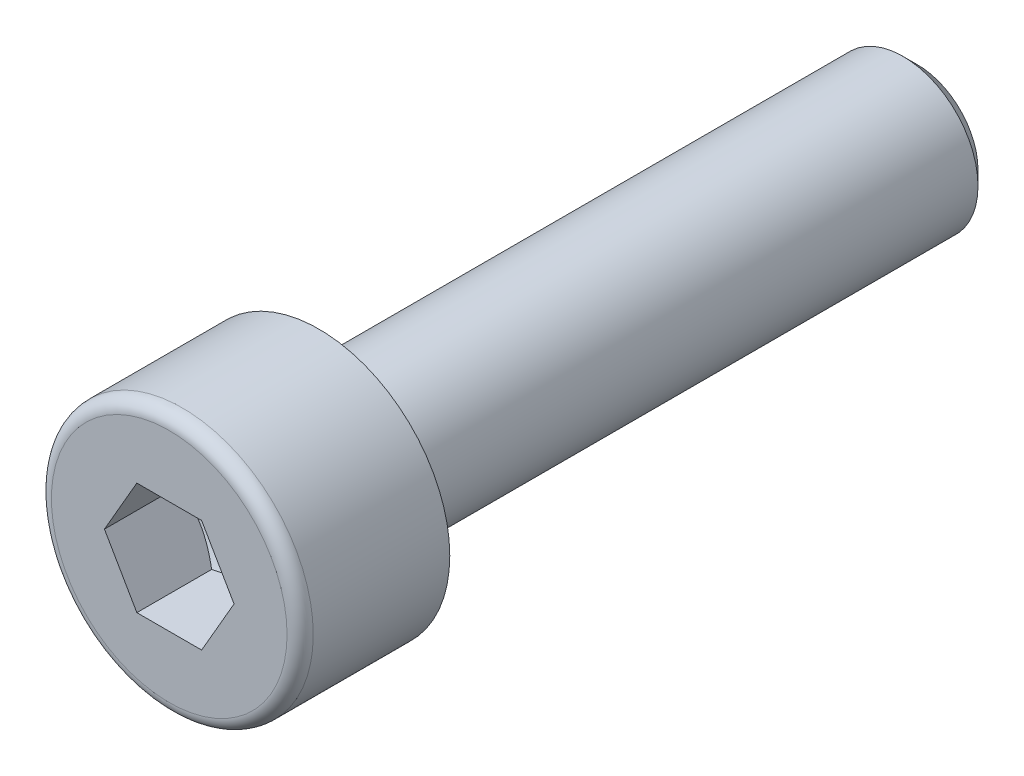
ISO-10303-21;
HEADER;
FILE_DESCRIPTION(('STEP AP214'),'2;1');
FILE_NAME('part.step','',(''),(''),'','','');
FILE_SCHEMA(('AUTOMOTIVE_DESIGN { 1 0 10303 214 1 1 1 1 }'));
ENDSEC;
DATA;
#1=APPLICATION_CONTEXT('core data for automotive mechanical design processes');
#2=APPLICATION_PROTOCOL_DEFINITION('international standard','automotive_design',2000,#1);
#3=PRODUCT_CONTEXT('',#1,'mechanical');
#4=PRODUCT('Part','Part','',(#3));
#5=PRODUCT_RELATED_PRODUCT_CATEGORY('part','',(#4));
#6=PRODUCT_DEFINITION_FORMATION('','',#4);
#7=PRODUCT_DEFINITION_CONTEXT('part definition',#1,'design');
#8=PRODUCT_DEFINITION('design','',#6,#7);
#9=PRODUCT_DEFINITION_SHAPE('','',#8);
#10=(LENGTH_UNIT() NAMED_UNIT(*) SI_UNIT(.MILLI.,.METRE.));
#11=(NAMED_UNIT(*) PLANE_ANGLE_UNIT() SI_UNIT($,.RADIAN.));
#12=(NAMED_UNIT(*) SI_UNIT($,.STERADIAN.) SOLID_ANGLE_UNIT());
#13=UNCERTAINTY_MEASURE_WITH_UNIT(LENGTH_MEASURE(1.E-05),#10,'distance_accuracy_value','');
#14=(GEOMETRIC_REPRESENTATION_CONTEXT(3) GLOBAL_UNCERTAINTY_ASSIGNED_CONTEXT((#13)) GLOBAL_UNIT_ASSIGNED_CONTEXT((#10,
#11,#12)) REPRESENTATION_CONTEXT('',''));
#15=CARTESIAN_POINT('',(0.,0.,0.));
#16=DIRECTION('',(0.,0.,1.));
#17=DIRECTION('',(1.,0.,0.));
#18=AXIS2_PLACEMENT_3D('',#15,#16,#17);
#19=CARTESIAN_POINT('',(0.,0.,4.));
#20=DIRECTION('',(0.,0.,1.));
#21=DIRECTION('',(1.,0.,0.));
#22=AXIS2_PLACEMENT_3D('',#19,#20,#21);
#23=PLANE('',#22);
#24=CARTESIAN_POINT('',(0.,0.,4.));
#25=DIRECTION('',(0.,0.,1.));
#26=DIRECTION('',(1.,0.,0.));
#27=AXIS2_PLACEMENT_3D('',#24,#25,#26);
#28=CIRCLE('',#27,3.15);
#29=CARTESIAN_POINT('',(3.15,0.,4.));
#30=VERTEX_POINT('',#29);
#31=EDGE_CURVE('E10',#30,#30,#28,.T.);
#32=ORIENTED_EDGE('',*,*,#31,.T.);
#33=EDGE_LOOP('',(#32));
#34=FACE_BOUND('',#33,.T.);
#35=DIRECTION('',(1.,0.,0.));
#36=VECTOR('',#35,1.);
#37=CARTESIAN_POINT('',(-0.866025,1.49999930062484,4.));
#38=LINE('',#37,#36);
#39=CARTESIAN_POINT('',(-0.866025,1.49999930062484,4.));
#40=VERTEX_POINT('',#39);
#41=CARTESIAN_POINT('',(0.866025,1.49999930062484,4.));
#42=VERTEX_POINT('',#41);
#43=EDGE_CURVE('E91',#40,#42,#38,.T.);
#44=ORIENTED_EDGE('',*,*,#43,.T.);
#45=DIRECTION('',(0.5,-0.866025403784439,0.));
#46=VECTOR('',#45,1.);
#47=CARTESIAN_POINT('',(0.866025,1.49999930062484,4.));
#48=LINE('',#47,#46);
#49=CARTESIAN_POINT('',(1.73205,0.,4.));
#50=VERTEX_POINT('',#49);
#51=EDGE_CURVE('E30',#42,#50,#48,.T.);
#52=ORIENTED_EDGE('',*,*,#51,.T.);
#53=DIRECTION('',(-0.5,-0.866025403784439,0.));
#54=VECTOR('',#53,1.);
#55=CARTESIAN_POINT('',(1.73205,0.,4.));
#56=LINE('',#55,#54);
#57=CARTESIAN_POINT('',(0.866025,-1.49999930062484,4.));
#58=VERTEX_POINT('',#57);
#59=EDGE_CURVE('E168',#50,#58,#56,.T.);
#60=ORIENTED_EDGE('',*,*,#59,.T.);
#61=DIRECTION('',(-1.,0.,0.));
#62=VECTOR('',#61,1.);
#63=CARTESIAN_POINT('',(0.866025,-1.49999930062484,4.));
#64=LINE('',#63,#62);
#65=CARTESIAN_POINT('',(-0.866025,-1.49999930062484,4.));
#66=VERTEX_POINT('',#65);
#67=EDGE_CURVE('E164',#58,#66,#64,.T.);
#68=ORIENTED_EDGE('',*,*,#67,.T.);
#69=DIRECTION('',(-0.5,0.866025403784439,0.));
#70=VECTOR('',#69,1.);
#71=CARTESIAN_POINT('',(-0.866025,-1.49999930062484,4.));
#72=LINE('',#71,#70);
#73=CARTESIAN_POINT('',(-1.73205,0.,4.));
#74=VERTEX_POINT('',#73);
#75=EDGE_CURVE('E159',#66,#74,#72,.T.);
#76=ORIENTED_EDGE('',*,*,#75,.T.);
#77=DIRECTION('',(0.5,0.866025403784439,0.));
#78=VECTOR('',#77,1.);
#79=CARTESIAN_POINT('',(-1.73205,0.,4.));
#80=LINE('',#79,#78);
#81=EDGE_CURVE('E95',#74,#40,#80,.T.);
#82=ORIENTED_EDGE('',*,*,#81,.T.);
#83=EDGE_LOOP('',(#44,#52,#60,#68,#76,#82));
#84=FACE_BOUND('',#83,.T.);
#85=ADVANCED_FACE('F16',(#34,#84),#23,.T.);
#86=CARTESIAN_POINT('',(0.,0.,3.65));
#87=DIRECTION('',(0.,0.,1.));
#88=DIRECTION('',(1.,0.,0.));
#89=AXIS2_PLACEMENT_3D('',#86,#87,#88);
#90=TOROIDAL_SURFACE('',#89,3.15,0.35);
#91=ORIENTED_EDGE('',*,*,#31,.F.);
#92=EDGE_LOOP('',(#91));
#93=FACE_BOUND('',#92,.T.);
#94=CARTESIAN_POINT('',(0.,0.,3.65));
#95=DIRECTION('',(0.,0.,1.));
#96=DIRECTION('',(1.,0.,0.));
#97=AXIS2_PLACEMENT_3D('',#94,#95,#96);
#98=CIRCLE('',#97,3.5);
#99=CARTESIAN_POINT('',(3.5,0.,3.65));
#100=VERTEX_POINT('',#99);
#101=EDGE_CURVE('E23',#100,#100,#98,.T.);
#102=ORIENTED_EDGE('',*,*,#101,.T.);
#103=EDGE_LOOP('',(#102));
#104=FACE_BOUND('',#103,.T.);
#105=ADVANCED_FACE('F132',(#93,#104),#90,.T.);
#106=CARTESIAN_POINT('',(0.,0.,4.));
#107=DIRECTION('',(0.,0.,1.));
#108=DIRECTION('',(1.,0.,0.));
#109=AXIS2_PLACEMENT_3D('',#106,#107,#108);
#110=CYLINDRICAL_SURFACE('',#109,3.5);
#111=CARTESIAN_POINT('',(0.,0.,0.));
#112=DIRECTION('',(0.,0.,1.));
#113=DIRECTION('',(1.,0.,0.));
#114=AXIS2_PLACEMENT_3D('',#111,#112,#113);
#115=CIRCLE('',#114,3.5);
#116=CARTESIAN_POINT('',(3.5,0.,0.));
#117=VERTEX_POINT('',#116);
#118=EDGE_CURVE('E127',#117,#117,#115,.T.);
#119=ORIENTED_EDGE('',*,*,#118,.T.);
#120=EDGE_LOOP('',(#119));
#121=FACE_BOUND('',#120,.T.);
#122=ORIENTED_EDGE('',*,*,#101,.F.);
#123=EDGE_LOOP('',(#122));
#124=FACE_BOUND('',#123,.T.);
#125=ADVANCED_FACE('F134',(#121,#124),#110,.T.);
#126=CARTESIAN_POINT('',(0.,3.5,0.));
#127=DIRECTION('',(0.,0.,-1.));
#128=DIRECTION('',(-1.,0.,0.));
#129=AXIS2_PLACEMENT_3D('',#126,#127,#128);
#130=PLANE('',#129);
#131=CARTESIAN_POINT('',(0.,0.,0.));
#132=DIRECTION('',(0.,0.,1.));
#133=DIRECTION('',(1.,0.,0.));
#134=AXIS2_PLACEMENT_3D('',#131,#132,#133);
#135=CIRCLE('',#134,2.2);
#136=CARTESIAN_POINT('',(2.2,0.,0.));
#137=VERTEX_POINT('',#136);
#138=EDGE_CURVE('E124',#137,#137,#135,.T.);
#139=ORIENTED_EDGE('',*,*,#138,.T.);
#140=EDGE_LOOP('',(#139));
#141=FACE_BOUND('',#140,.T.);
#142=ORIENTED_EDGE('',*,*,#118,.F.);
#143=EDGE_LOOP('',(#142));
#144=FACE_BOUND('',#143,.T.);
#145=ADVANCED_FACE('F136',(#141,#144),#130,.T.);
#146=CARTESIAN_POINT('',(0.,0.,-0.2));
#147=DIRECTION('',(0.,0.,1.));
#148=DIRECTION('',(1.,0.,0.));
#149=AXIS2_PLACEMENT_3D('',#146,#147,#148);
#150=TOROIDAL_SURFACE('',#149,2.2,0.2);
#151=CARTESIAN_POINT('',(0.,0.,-0.2));
#152=DIRECTION('',(0.,0.,1.));
#153=DIRECTION('',(1.,0.,0.));
#154=AXIS2_PLACEMENT_3D('',#151,#152,#153);
#155=CIRCLE('',#154,2.);
#156=CARTESIAN_POINT('',(2.,0.,-0.2));
#157=VERTEX_POINT('',#156);
#158=EDGE_CURVE('E121',#157,#157,#155,.T.);
#159=ORIENTED_EDGE('',*,*,#158,.T.);
#160=EDGE_LOOP('',(#159));
#161=FACE_BOUND('',#160,.T.);
#162=ORIENTED_EDGE('',*,*,#138,.F.);
#163=EDGE_LOOP('',(#162));
#164=FACE_BOUND('',#163,.T.);
#165=ADVANCED_FACE('F144',(#161,#164),#150,.F.);
#166=CARTESIAN_POINT('',(0.,0.,4.));
#167=DIRECTION('',(0.,0.,1.));
#168=DIRECTION('',(1.,0.,0.));
#169=AXIS2_PLACEMENT_3D('',#166,#167,#168);
#170=CYLINDRICAL_SURFACE('',#169,2.);
#171=CARTESIAN_POINT('',(0.,0.,-0.201));
#172=DIRECTION('',(0.,0.,1.));
#173=DIRECTION('',(1.,0.,0.));
#174=AXIS2_PLACEMENT_3D('',#171,#172,#173);
#175=CIRCLE('',#174,2.);
#176=CARTESIAN_POINT('',(2.,0.,-0.201));
#177=VERTEX_POINT('',#176);
#178=EDGE_CURVE('E118',#177,#177,#175,.T.);
#179=ORIENTED_EDGE('',*,*,#178,.T.);
#180=EDGE_LOOP('',(#179));
#181=FACE_BOUND('',#180,.T.);
#182=ORIENTED_EDGE('',*,*,#158,.F.);
#183=EDGE_LOOP('',(#182));
#184=FACE_BOUND('',#183,.T.);
#185=ADVANCED_FACE('F311',(#181,#184),#170,.T.);
#186=CARTESIAN_POINT('',(0.,0.,-0.201));
#187=DIRECTION('',(0.,0.,1.));
#188=DIRECTION('',(1.,0.,0.));
#189=AXIS2_PLACEMENT_3D('',#186,#187,#188);
#190=CONICAL_SURFACE('',#189,2.,0.523598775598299);
#191=CARTESIAN_POINT('',(0.,0.,-0.857230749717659));
#192=DIRECTION('',(0.,0.,1.));
#193=DIRECTION('',(1.,0.,0.));
#194=AXIS2_PLACEMENT_3D('',#191,#192,#193);
#195=CIRCLE('',#194,1.621125);
#196=CARTESIAN_POINT('',(1.621125,0.,-0.857230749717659));
#197=VERTEX_POINT('',#196);
#198=EDGE_CURVE('E115',#197,#197,#195,.T.);
#199=ORIENTED_EDGE('',*,*,#198,.T.);
#200=EDGE_LOOP('',(#199));
#201=FACE_BOUND('',#200,.T.);
#202=ORIENTED_EDGE('',*,*,#178,.F.);
#203=EDGE_LOOP('',(#202));
#204=FACE_BOUND('',#203,.T.);
#205=ADVANCED_FACE('F303',(#201,#204),#190,.T.);
#206=CARTESIAN_POINT('',(0.,1.621125,-0.857230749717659));
#207=DIRECTION('',(0.,0.,1.));
#208=DIRECTION('',(1.,0.,0.));
#209=AXIS2_PLACEMENT_3D('',#206,#207,#208);
#210=PLANE('',#209);
#211=CARTESIAN_POINT('',(0.,0.,-0.857230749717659));
#212=DIRECTION('',(0.,0.,1.));
#213=DIRECTION('',(1.,0.,0.));
#214=AXIS2_PLACEMENT_3D('',#211,#212,#213);
#215=CIRCLE('',#214,2.);
#216=CARTESIAN_POINT('',(2.,0.,-0.857230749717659));
#217=VERTEX_POINT('',#216);
#218=EDGE_CURVE('E112',#217,#217,#215,.T.);
#219=ORIENTED_EDGE('',*,*,#218,.T.);
#220=EDGE_LOOP('',(#219));
#221=FACE_BOUND('',#220,.T.);
#222=ORIENTED_EDGE('',*,*,#198,.F.);
#223=EDGE_LOOP('',(#222));
#224=FACE_BOUND('',#223,.T.);
#225=ADVANCED_FACE('F295',(#221,#224),#210,.T.);
#226=CARTESIAN_POINT('',(0.,0.,4.));
#227=DIRECTION('',(0.,0.,1.));
#228=DIRECTION('',(1.,0.,0.));
#229=AXIS2_PLACEMENT_3D('',#226,#227,#228);
#230=CYLINDRICAL_SURFACE('',#229,2.);
#231=CARTESIAN_POINT('',(0.,0.,-15.621125));
#232=DIRECTION('',(0.,0.,1.));
#233=DIRECTION('',(1.,0.,0.));
#234=AXIS2_PLACEMENT_3D('',#231,#232,#233);
#235=CIRCLE('',#234,2.);
#236=CARTESIAN_POINT('',(2.,0.,-15.621125));
#237=VERTEX_POINT('',#236);
#238=EDGE_CURVE('E109',#237,#237,#235,.T.);
#239=ORIENTED_EDGE('',*,*,#238,.T.);
#240=EDGE_LOOP('',(#239));
#241=FACE_BOUND('',#240,.T.);
#242=ORIENTED_EDGE('',*,*,#218,.F.);
#243=EDGE_LOOP('',(#242));
#244=FACE_BOUND('',#243,.T.);
#245=ADVANCED_FACE('F287',(#241,#244),#230,.T.);
#246=CARTESIAN_POINT('',(0.,0.,-15.621125));
#247=DIRECTION('',(0.,0.,1.));
#248=DIRECTION('',(1.,0.,0.));
#249=AXIS2_PLACEMENT_3D('',#246,#247,#248);
#250=CONICAL_SURFACE('',#249,2.,0.785398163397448);
#251=CARTESIAN_POINT('',(0.,0.,-16.));
#252=DIRECTION('',(0.,0.,1.));
#253=DIRECTION('',(1.,0.,0.));
#254=AXIS2_PLACEMENT_3D('',#251,#252,#253);
#255=CIRCLE('',#254,1.621125);
#256=CARTESIAN_POINT('',(1.621125,0.,-16.));
#257=VERTEX_POINT('',#256);
#258=EDGE_CURVE('E106',#257,#257,#255,.T.);
#259=ORIENTED_EDGE('',*,*,#258,.T.);
#260=EDGE_LOOP('',(#259));
#261=FACE_BOUND('',#260,.T.);
#262=ORIENTED_EDGE('',*,*,#238,.F.);
#263=EDGE_LOOP('',(#262));
#264=FACE_BOUND('',#263,.T.);
#265=ADVANCED_FACE('F280',(#261,#264),#250,.T.);
#266=CARTESIAN_POINT('',(0.,1.621125,-16.));
#267=DIRECTION('',(0.,0.,-1.));
#268=DIRECTION('',(-1.,0.,0.));
#269=AXIS2_PLACEMENT_3D('',#266,#267,#268);
#270=PLANE('',#269);
#271=ORIENTED_EDGE('',*,*,#258,.F.);
#272=EDGE_LOOP('',(#271));
#273=FACE_BOUND('',#272,.T.);
#274=ADVANCED_FACE('F224',(#273),#270,.T.);
#275=CARTESIAN_POINT('',(0.866025,1.49999930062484,1.00000046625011));
#276=DIRECTION('',(-0.866025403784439,-0.5,0.));
#277=DIRECTION('',(-0.5,0.866025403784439,0.));
#278=AXIS2_PLACEMENT_3D('',#275,#276,#277);
#279=PLANE('',#278);
#280=DIRECTION('',(0.,0.,1.));
#281=VECTOR('',#280,1.);
#282=CARTESIAN_POINT('',(1.73205,0.,1.00000046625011));
#283=LINE('',#282,#281);
#284=CARTESIAN_POINT('',(1.73205,0.,2.));
#285=VERTEX_POINT('',#284);
#286=EDGE_CURVE('E104',#285,#50,#283,.T.);
#287=ORIENTED_EDGE('',*,*,#286,.T.);
#288=ORIENTED_EDGE('',*,*,#51,.F.);
#289=DIRECTION('',(0.,0.,1.));
#290=VECTOR('',#289,1.);
#291=CARTESIAN_POINT('',(0.866025,1.49999930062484,1.00000046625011));
#292=LINE('',#291,#290);
#293=CARTESIAN_POINT('',(0.866025,1.49999930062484,2.));
#294=VERTEX_POINT('',#293);
#295=EDGE_CURVE('E85',#294,#42,#292,.T.);
#296=ORIENTED_EDGE('',*,*,#295,.F.);
#297=CARTESIAN_POINT('',(1.73205011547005,-2.E-07,2.00000006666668));
#298=CARTESIAN_POINT('',(1.69399355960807,0.0659156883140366,1.97802173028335));
#299=CARTESIAN_POINT('',(1.65560850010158,0.132400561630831,1.95803358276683));
#300=CARTESIAN_POINT('',(1.57817376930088,0.266521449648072,1.92314486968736));
#301=CARTESIAN_POINT('',(1.53912272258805,0.334159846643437,1.90825664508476));
#302=CARTESIAN_POINT('',(1.46150456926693,0.468598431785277,1.88508204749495));
#303=CARTESIAN_POINT('',(1.42294940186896,0.535377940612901,1.87664141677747));
#304=CARTESIAN_POINT('',(1.3456577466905,0.669251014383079,1.86656694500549));
#305=CARTESIAN_POINT('',(1.30692153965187,0.736344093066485,1.86492475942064));
#306=CARTESIAN_POINT('',(1.23454707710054,0.861700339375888,1.86834977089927));
#307=CARTESIAN_POINT('',(1.20089796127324,0.919982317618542,1.87257601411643));
#308=CARTESIAN_POINT('',(1.13381894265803,1.03616658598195,1.88596802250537));
#309=CARTESIAN_POINT('',(1.10038927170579,1.09406847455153,1.8951383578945));
#310=CARTESIAN_POINT('',(1.03317206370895,1.21049209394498,1.91806242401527));
#311=CARTESIAN_POINT('',(0.99939302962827,1.26899909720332,1.93191328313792));
#312=CARTESIAN_POINT('',(0.932338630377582,1.38514072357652,1.96334887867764));
#313=CARTESIAN_POINT('',(0.899062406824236,1.44277683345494,1.98092623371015));
#314=CARTESIAN_POINT('',(0.866024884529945,1.49999950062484,2.00000006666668));
#315=B_SPLINE_CURVE_WITH_KNOTS('',3,(#297,#298,#299,#300,#301,#302,#303,#304,#305,#306,#307,
#308,#309,#310,#311,#312,#313,#314),.UNSPECIFIED.,.F.,.F.,(4,2,2,2,2,2,2,2,4),(0.,
0.237761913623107,0.476095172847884,0.70853042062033,0.940680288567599,1.14278046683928,
1.34506778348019,1.5518408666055,1.75820814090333),.UNSPECIFIED.);
#316=EDGE_CURVE('E78',#285,#294,#315,.T.);
#317=ORIENTED_EDGE('',*,*,#316,.F.);
#318=EDGE_LOOP('',(#287,#288,#296,#317));
#319=FACE_BOUND('',#318,.T.);
#320=ADVANCED_FACE('F86',(#319),#279,.T.);
#321=CARTESIAN_POINT('',(1.73205,0.,1.00000046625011));
#322=DIRECTION('',(-0.866025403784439,0.5,0.));
#323=DIRECTION('',(0.5,0.866025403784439,0.));
#324=AXIS2_PLACEMENT_3D('',#321,#322,#323);
#325=PLANE('',#324);
#326=DIRECTION('',(0.,0.,1.));
#327=VECTOR('',#326,1.);
#328=CARTESIAN_POINT('',(0.866025,-1.49999930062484,1.00000046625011));
#329=LINE('',#328,#327);
#330=CARTESIAN_POINT('',(0.866025,-1.49999930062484,2.));
#331=VERTEX_POINT('',#330);
#332=EDGE_CURVE('E102',#331,#58,#329,.T.);
#333=ORIENTED_EDGE('',*,*,#332,.T.);
#334=ORIENTED_EDGE('',*,*,#59,.F.);
#335=ORIENTED_EDGE('',*,*,#286,.F.);
#336=CARTESIAN_POINT('',(0.866024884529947,-1.49999950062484,2.00000006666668));
#337=CARTESIAN_POINT('',(0.904081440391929,-1.4340836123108,1.97802173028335));
#338=CARTESIAN_POINT('',(0.942466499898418,-1.36759873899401,1.95803358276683));
#339=CARTESIAN_POINT('',(1.01990123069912,-1.23347785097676,1.92314486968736));
#340=CARTESIAN_POINT('',(1.05895227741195,-1.1658394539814,1.90825664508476));
#341=CARTESIAN_POINT('',(1.13657043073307,-1.03140086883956,1.88508204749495));
#342=CARTESIAN_POINT('',(1.17512559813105,-0.964621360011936,1.87664141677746));
#343=CARTESIAN_POINT('',(1.2524172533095,-0.830748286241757,1.86656694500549));
#344=CARTESIAN_POINT('',(1.29115346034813,-0.763655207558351,1.86492475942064));
#345=CARTESIAN_POINT('',(1.36352792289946,-0.638298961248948,1.86834977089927));
#346=CARTESIAN_POINT('',(1.39717703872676,-0.580016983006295,1.87257601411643));
#347=CARTESIAN_POINT('',(1.46425605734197,-0.46383271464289,1.88596802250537));
#348=CARTESIAN_POINT('',(1.49768572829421,-0.405930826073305,1.8951383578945));
#349=CARTESIAN_POINT('',(1.56490293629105,-0.289507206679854,1.91806242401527));
#350=CARTESIAN_POINT('',(1.59868197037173,-0.231000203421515,1.93191328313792));
#351=CARTESIAN_POINT('',(1.66573636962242,-0.114858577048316,1.96334887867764));
#352=CARTESIAN_POINT('',(1.69901259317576,-0.0572224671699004,1.98092623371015));
#353=CARTESIAN_POINT('',(1.73205011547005,1.99999999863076E-07,2.00000006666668));
#354=B_SPLINE_CURVE_WITH_KNOTS('',3,(#336,#337,#338,#339,#340,#341,#342,#343,#344,#345,#346,
#347,#348,#349,#350,#351,#352,#353),.UNSPECIFIED.,.F.,.F.,(4,2,2,2,2,2,2,2,4),(0.,
0.237761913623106,0.476095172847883,0.708530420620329,0.940680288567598,1.14278046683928,
1.34506778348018,1.5518408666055,1.75820814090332),.UNSPECIFIED.);
#355=EDGE_CURVE('E82',#331,#285,#354,.T.);
#356=ORIENTED_EDGE('',*,*,#355,.F.);
#357=EDGE_LOOP('',(#333,#334,#335,#356));
#358=FACE_BOUND('',#357,.T.);
#359=ADVANCED_FACE('F215',(#358),#325,.T.);
#360=CARTESIAN_POINT('',(0.866025,-1.49999930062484,1.00000046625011));
#361=DIRECTION('',(0.,1.,0.));
#362=DIRECTION('',(1.,0.,0.));
#363=AXIS2_PLACEMENT_3D('',#360,#361,#362);
#364=PLANE('',#363);
#365=DIRECTION('',(0.,0.,1.));
#366=VECTOR('',#365,1.);
#367=CARTESIAN_POINT('',(-0.866025,-1.49999930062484,1.00000046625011));
#368=LINE('',#367,#366);
#369=CARTESIAN_POINT('',(-0.866025,-1.49999930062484,2.));
#370=VERTEX_POINT('',#369);
#371=EDGE_CURVE('E100',#370,#66,#368,.T.);
#372=ORIENTED_EDGE('',*,*,#371,.T.);
#373=ORIENTED_EDGE('',*,*,#67,.F.);
#374=ORIENTED_EDGE('',*,*,#332,.F.);
#375=CARTESIAN_POINT('',(-2.24271663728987,-1.49999930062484,2.55775267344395));
#376=CARTESIAN_POINT('',(-2.17794141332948,-1.49999930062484,2.5266759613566));
#377=CARTESIAN_POINT('',(-2.11300852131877,-1.49999930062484,2.49592211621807));
#378=CARTESIAN_POINT('',(-1.98274303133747,-1.49999930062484,2.43524311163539));
#379=CARTESIAN_POINT('',(-1.91741036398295,-1.49999930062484,2.40531810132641));
#380=CARTESIAN_POINT('',(-1.78588635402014,-1.49999930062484,2.34631254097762));
#381=CARTESIAN_POINT('',(-1.71969220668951,-1.49999930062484,2.31723821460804));
#382=CARTESIAN_POINT('',(-1.58674953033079,-1.49999930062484,2.26039396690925));
#383=CARTESIAN_POINT('',(-1.52000103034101,-1.49999930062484,2.23262397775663));
#384=CARTESIAN_POINT('',(-1.3840803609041,-1.49999930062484,2.17802545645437));
#385=CARTESIAN_POINT('',(-1.31489044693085,-1.49999930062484,2.15124051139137));
#386=CARTESIAN_POINT('',(-1.17568875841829,-1.49999930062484,2.09990652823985));
#387=CARTESIAN_POINT('',(-1.10567688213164,-1.49999930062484,2.07535777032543));
#388=CARTESIAN_POINT('',(-0.89452221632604,-1.49999930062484,2.00610108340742));
#389=CARTESIAN_POINT('',(-0.751873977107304,-1.49999930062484,1.96562027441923));
#390=CARTESIAN_POINT('',(-0.535047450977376,-1.49999930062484,1.91866452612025));
#391=CARTESIAN_POINT('',(-0.462365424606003,-1.49999930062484,1.9053129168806));
#392=CARTESIAN_POINT('',(-0.316183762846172,-1.49999930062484,1.88411347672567));
#393=CARTESIAN_POINT('',(-0.242684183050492,-1.49999930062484,1.8762652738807));
#394=CARTESIAN_POINT('',(-0.0961588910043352,-1.49999930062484,1.86679859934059));
#395=CARTESIAN_POINT('',(-0.0231380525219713,-1.49999930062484,1.86510661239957));
#396=CARTESIAN_POINT('',(0.122783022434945,-1.49999930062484,1.8678994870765));
#397=CARTESIAN_POINT('',(0.195683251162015,-1.49999930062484,1.87238473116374));
#398=CARTESIAN_POINT('',(0.37555374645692,-1.49999930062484,1.89067768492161));
#399=CARTESIAN_POINT('',(0.482175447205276,-1.49999930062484,1.90791354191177));
#400=CARTESIAN_POINT('',(0.693345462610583,-1.49999930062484,1.95235984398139));
#401=CARTESIAN_POINT('',(0.797891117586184,-1.49999930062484,1.97958231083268));
#402=CARTESIAN_POINT('',(0.954250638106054,-1.49999930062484,2.02608493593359));
#403=CARTESIAN_POINT('',(1.00687274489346,-1.49999930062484,2.04274751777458));
#404=CARTESIAN_POINT('',(1.11156919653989,-1.49999930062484,2.07761406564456));
#405=CARTESIAN_POINT('',(1.16364386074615,-1.49999930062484,2.09581706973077));
#406=CARTESIAN_POINT('',(1.26731501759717,-1.49999930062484,2.13350010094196));
#407=CARTESIAN_POINT('',(1.31891159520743,-1.49999930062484,2.15297989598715));
#408=CARTESIAN_POINT('',(1.4216981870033,-1.49999930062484,2.19300580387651));
#409=CARTESIAN_POINT('',(1.47288813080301,-1.49999930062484,2.21355209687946));
#410=CARTESIAN_POINT('',(1.60355204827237,-1.49999930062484,2.26731329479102));
#411=CARTESIAN_POINT('',(1.68276475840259,-1.49999930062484,2.30116250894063));
#412=CARTESIAN_POINT('',(1.84047486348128,-1.49999930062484,2.37049265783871));
#413=CARTESIAN_POINT('',(1.91897220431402,-1.49999930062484,2.40597371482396));
#414=CARTESIAN_POINT('',(2.15362953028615,-1.49999930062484,2.51428940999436));
#415=CARTESIAN_POINT('',(2.30892860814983,-1.49999930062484,2.58898546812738));
#416=CARTESIAN_POINT('',(2.61819999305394,-1.49999930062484,2.74151032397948));
#417=CARTESIAN_POINT('',(2.77217043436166,-1.49999930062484,2.81934285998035));
#418=CARTESIAN_POINT('',(3.07905639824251,-1.49999930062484,2.97700926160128));
#419=CARTESIAN_POINT('',(3.23197205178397,-1.49999930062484,3.05684287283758));
#420=CARTESIAN_POINT('',(3.52267463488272,-1.49999930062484,3.21028846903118));
#421=CARTESIAN_POINT('',(3.66052723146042,-1.49999930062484,3.28377647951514));
#422=CARTESIAN_POINT('',(3.93578899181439,-1.49999930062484,3.43158982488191));
#423=CARTESIAN_POINT('',(4.07319813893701,-1.49999930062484,3.50591519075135));
#424=CARTESIAN_POINT('',(4.34732572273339,-1.49999930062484,3.65500341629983));
#425=CARTESIAN_POINT('',(4.48404502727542,-1.49999930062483,3.72976468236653));
#426=CARTESIAN_POINT('',(4.75720722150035,-1.49999930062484,3.87977380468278));
#427=CARTESIAN_POINT('',(4.89365012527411,-1.49999930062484,3.95502163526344));
#428=CARTESIAN_POINT('',(5.02999372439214,-1.49999930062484,4.03044789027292));
#429=B_SPLINE_CURVE_WITH_KNOTS('',3,(#375,#376,#377,#378,#379,#380,#381,#382,#383,#384,#385,
#386,#387,#388,#389,#390,#391,#392,#393,#394,#395,#396,#397,#398,#399,#400,#401,#402,#403,#404,
#405,#406,#407,#408,#409,#410,#411,#412,#413,#414,#415,#416,#417,#418,#419,#420,#421,#422,#423,
#424,#425,#426,#427,#428),.UNSPECIFIED.,.F.,.F.,(4,2,2,2,2,2,2,2,2,2,2,2,2,2,2,2,2,2,2,2,2,2,2,
2,2,2,4),(0.,0.215535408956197,0.431109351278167,0.647990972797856,0.864861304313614,
1.08740082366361,1.30996818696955,1.75384735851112,1.97537373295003,2.19688513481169,
2.4157424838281,2.63461338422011,2.9579662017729,3.28170955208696,3.4472828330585,
3.61275347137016,3.77819411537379,3.94366279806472,4.20206177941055,4.46048014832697,
4.97740223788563,5.49495979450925,6.012451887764,6.48110033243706,6.94976617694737,
7.4172399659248,7.88468929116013),.UNSPECIFIED.);
#430=EDGE_CURVE('E206',#370,#331,#429,.T.);
#431=ORIENTED_EDGE('',*,*,#430,.F.);
#432=EDGE_LOOP('',(#372,#373,#374,#431));
#433=FACE_BOUND('',#432,.T.);
#434=ADVANCED_FACE('F211',(#433),#364,.T.);
#435=CARTESIAN_POINT('',(-0.866025,-1.49999930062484,1.00000046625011));
#436=DIRECTION('',(0.866025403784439,0.5,0.));
#437=DIRECTION('',(0.5,-0.866025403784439,0.));
#438=AXIS2_PLACEMENT_3D('',#435,#436,#437);
#439=PLANE('',#438);
#440=DIRECTION('',(0.,0.,1.));
#441=VECTOR('',#440,1.);
#442=CARTESIAN_POINT('',(-1.73205,0.,1.00000046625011));
#443=LINE('',#442,#441);
#444=CARTESIAN_POINT('',(-1.73205,0.,2.));
#445=VERTEX_POINT('',#444);
#446=EDGE_CURVE('E93',#445,#74,#443,.T.);
#447=ORIENTED_EDGE('',*,*,#446,.T.);
#448=ORIENTED_EDGE('',*,*,#75,.F.);
#449=ORIENTED_EDGE('',*,*,#371,.F.);
#450=CARTESIAN_POINT('',(-1.73205011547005,1.99999999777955E-07,2.00000006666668));
#451=CARTESIAN_POINT('',(-1.69399355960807,-0.065915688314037,1.97802173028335));
#452=CARTESIAN_POINT('',(-1.65560850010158,-0.132400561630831,1.95803358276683));
#453=CARTESIAN_POINT('',(-1.57817376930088,-0.266521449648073,1.92314486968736));
#454=CARTESIAN_POINT('',(-1.53912272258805,-0.334159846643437,1.90825664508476));
#455=CARTESIAN_POINT('',(-1.46150456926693,-0.468598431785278,1.88508204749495));
#456=CARTESIAN_POINT('',(-1.42294940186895,-0.535377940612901,1.87664141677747));
#457=CARTESIAN_POINT('',(-1.3456577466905,-0.66925101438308,1.86656694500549));
#458=CARTESIAN_POINT('',(-1.30692153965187,-0.736344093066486,1.86492475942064));
#459=CARTESIAN_POINT('',(-1.23454707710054,-0.861700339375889,1.86834977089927));
#460=CARTESIAN_POINT('',(-1.20089796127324,-0.919982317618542,1.87257601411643));
#461=CARTESIAN_POINT('',(-1.13381894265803,-1.03616658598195,1.88596802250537));
#462=CARTESIAN_POINT('',(-1.10038927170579,-1.09406847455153,1.8951383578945));
#463=CARTESIAN_POINT('',(-1.03317206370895,-1.21049209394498,1.91806242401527));
#464=CARTESIAN_POINT('',(-0.999393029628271,-1.26899909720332,1.93191328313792));
#465=CARTESIAN_POINT('',(-0.932338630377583,-1.38514072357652,1.96334887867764));
#466=CARTESIAN_POINT('',(-0.899062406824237,-1.44277683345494,1.98092623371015));
#467=CARTESIAN_POINT('',(-0.866024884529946,-1.49999950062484,2.00000006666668));
#468=B_SPLINE_CURVE_WITH_KNOTS('',3,(#450,#451,#452,#453,#454,#455,#456,#457,#458,#459,#460,
#461,#462,#463,#464,#465,#466,#467),.UNSPECIFIED.,.F.,.F.,(4,2,2,2,2,2,2,2,4),(0.,
0.237761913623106,0.476095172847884,0.708530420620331,0.940680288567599,1.14278046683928,
1.34506778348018,1.5518408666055,1.75820814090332),.UNSPECIFIED.);
#469=EDGE_CURVE('E201',#445,#370,#468,.T.);
#470=ORIENTED_EDGE('',*,*,#469,.F.);
#471=EDGE_LOOP('',(#447,#448,#449,#470));
#472=FACE_BOUND('',#471,.T.);
#473=ADVANCED_FACE('F214',(#472),#439,.T.);
#474=CARTESIAN_POINT('',(-1.73205,0.,1.00000046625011));
#475=DIRECTION('',(0.866025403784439,-0.5,0.));
#476=DIRECTION('',(-0.5,-0.866025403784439,0.));
#477=AXIS2_PLACEMENT_3D('',#474,#475,#476);
#478=PLANE('',#477);
#479=DIRECTION('',(0.,0.,1.));
#480=VECTOR('',#479,1.);
#481=CARTESIAN_POINT('',(-0.866025,1.49999930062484,1.00000046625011));
#482=LINE('',#481,#480);
#483=CARTESIAN_POINT('',(-0.866025,1.49999930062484,2.));
#484=VERTEX_POINT('',#483);
#485=EDGE_CURVE('E90',#484,#40,#482,.T.);
#486=ORIENTED_EDGE('',*,*,#485,.T.);
#487=ORIENTED_EDGE('',*,*,#81,.F.);
#488=ORIENTED_EDGE('',*,*,#446,.F.);
#489=CARTESIAN_POINT('',(-0.866024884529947,1.49999950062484,2.00000006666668));
#490=CARTESIAN_POINT('',(-0.904081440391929,1.4340836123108,1.97802173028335));
#491=CARTESIAN_POINT('',(-0.942466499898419,1.367598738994,1.95803358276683));
#492=CARTESIAN_POINT('',(-1.01990123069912,1.23347785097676,1.92314486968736));
#493=CARTESIAN_POINT('',(-1.05895227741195,1.1658394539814,1.90825664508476));
#494=CARTESIAN_POINT('',(-1.13657043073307,1.03140086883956,1.88508204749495));
#495=CARTESIAN_POINT('',(-1.17512559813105,0.964621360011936,1.87664141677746));
#496=CARTESIAN_POINT('',(-1.2524172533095,0.830748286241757,1.86656694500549));
#497=CARTESIAN_POINT('',(-1.29115346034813,0.763655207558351,1.86492475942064));
#498=CARTESIAN_POINT('',(-1.36352792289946,0.638298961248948,1.86834977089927));
#499=CARTESIAN_POINT('',(-1.39717703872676,0.580016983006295,1.87257601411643));
#500=CARTESIAN_POINT('',(-1.46425605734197,0.46383271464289,1.88596802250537));
#501=CARTESIAN_POINT('',(-1.49768572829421,0.405930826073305,1.8951383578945));
#502=CARTESIAN_POINT('',(-1.56490293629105,0.289507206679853,1.91806242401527));
#503=CARTESIAN_POINT('',(-1.59868197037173,0.231000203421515,1.93191328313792));
#504=CARTESIAN_POINT('',(-1.66573636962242,0.114858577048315,1.96334887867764));
#505=CARTESIAN_POINT('',(-1.69901259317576,0.0572224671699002,1.98092623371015));
#506=CARTESIAN_POINT('',(-1.73205011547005,-2.00000000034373E-07,2.00000006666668));
#507=B_SPLINE_CURVE_WITH_KNOTS('',3,(#489,#490,#491,#492,#493,#494,#495,#496,#497,#498,#499,
#500,#501,#502,#503,#504,#505,#506),.UNSPECIFIED.,.F.,.F.,(4,2,2,2,2,2,2,2,4),(0.,
0.237761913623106,0.476095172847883,0.708530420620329,0.940680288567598,1.14278046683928,
1.34506778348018,1.5518408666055,1.75820814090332),.UNSPECIFIED.);
#508=EDGE_CURVE('E38',#484,#445,#507,.T.);
#509=ORIENTED_EDGE('',*,*,#508,.F.);
#510=EDGE_LOOP('',(#486,#487,#488,#509));
#511=FACE_BOUND('',#510,.T.);
#512=ADVANCED_FACE('F158',(#511),#478,.T.);
#513=CARTESIAN_POINT('',(-0.866025,1.49999930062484,1.00000046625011));
#514=DIRECTION('',(0.,-1.,0.));
#515=DIRECTION('',(-1.,0.,0.));
#516=AXIS2_PLACEMENT_3D('',#513,#514,#515);
#517=PLANE('',#516);
#518=ORIENTED_EDGE('',*,*,#295,.T.);
#519=ORIENTED_EDGE('',*,*,#43,.F.);
#520=ORIENTED_EDGE('',*,*,#485,.F.);
#521=CARTESIAN_POINT('',(-2.24271663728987,1.49999930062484,2.55775267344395));
#522=CARTESIAN_POINT('',(-2.17794141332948,1.49999930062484,2.5266759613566));
#523=CARTESIAN_POINT('',(-2.11300852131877,1.49999930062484,2.49592211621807));
#524=CARTESIAN_POINT('',(-1.98274303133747,1.49999930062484,2.43524311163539));
#525=CARTESIAN_POINT('',(-1.91741036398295,1.49999930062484,2.40531810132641));
#526=CARTESIAN_POINT('',(-1.78588635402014,1.49999930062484,2.34631254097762));
#527=CARTESIAN_POINT('',(-1.71969220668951,1.49999930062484,2.31723821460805));
#528=CARTESIAN_POINT('',(-1.58674953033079,1.49999930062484,2.26039396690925));
#529=CARTESIAN_POINT('',(-1.52000103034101,1.49999930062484,2.23262397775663));
#530=CARTESIAN_POINT('',(-1.3840803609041,1.49999930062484,2.17802545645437));
#531=CARTESIAN_POINT('',(-1.31489044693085,1.49999930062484,2.15124051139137));
#532=CARTESIAN_POINT('',(-1.17568875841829,1.49999930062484,2.09990652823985));
#533=CARTESIAN_POINT('',(-1.10567688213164,1.49999930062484,2.07535777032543));
#534=CARTESIAN_POINT('',(-0.894522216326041,1.49999930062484,2.00610108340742));
#535=CARTESIAN_POINT('',(-0.751873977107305,1.49999930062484,1.96562027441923));
#536=CARTESIAN_POINT('',(-0.535047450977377,1.49999930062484,1.91866452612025));
#537=CARTESIAN_POINT('',(-0.462365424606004,1.49999930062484,1.9053129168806));
#538=CARTESIAN_POINT('',(-0.316183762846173,1.49999930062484,1.88411347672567));
#539=CARTESIAN_POINT('',(-0.242684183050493,1.49999930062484,1.8762652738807));
#540=CARTESIAN_POINT('',(-0.0961588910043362,1.49999930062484,1.86679859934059));
#541=CARTESIAN_POINT('',(-0.0231380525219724,1.49999930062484,1.86510661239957));
#542=CARTESIAN_POINT('',(0.122783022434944,1.49999930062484,1.8678994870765));
#543=CARTESIAN_POINT('',(0.195683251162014,1.49999930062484,1.87238473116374));
#544=CARTESIAN_POINT('',(0.375553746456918,1.49999930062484,1.89067768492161));
#545=CARTESIAN_POINT('',(0.482175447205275,1.49999930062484,1.90791354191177));
#546=CARTESIAN_POINT('',(0.69334546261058,1.49999930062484,1.95235984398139));
#547=CARTESIAN_POINT('',(0.797891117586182,1.49999930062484,1.97958231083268));
#548=CARTESIAN_POINT('',(0.954250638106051,1.49999930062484,2.02608493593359));
#549=CARTESIAN_POINT('',(1.00687274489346,1.49999930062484,2.04274751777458));
#550=CARTESIAN_POINT('',(1.11156919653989,1.49999930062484,2.07761406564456));
#551=CARTESIAN_POINT('',(1.16364386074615,1.49999930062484,2.09581706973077));
#552=CARTESIAN_POINT('',(1.26731501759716,1.49999930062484,2.13350010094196));
#553=CARTESIAN_POINT('',(1.31891159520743,1.49999930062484,2.15297989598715));
#554=CARTESIAN_POINT('',(1.4216981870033,1.49999930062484,2.19300580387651));
#555=CARTESIAN_POINT('',(1.472888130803,1.49999930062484,2.21355209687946));
#556=CARTESIAN_POINT('',(1.60355204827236,1.49999930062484,2.26731329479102));
#557=CARTESIAN_POINT('',(1.68276475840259,1.49999930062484,2.30116250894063));
#558=CARTESIAN_POINT('',(1.84047486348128,1.49999930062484,2.37049265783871));
#559=CARTESIAN_POINT('',(1.91897220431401,1.49999930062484,2.40597371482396));
#560=CARTESIAN_POINT('',(2.15362953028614,1.49999930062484,2.51428940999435));
#561=CARTESIAN_POINT('',(2.30892860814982,1.49999930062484,2.58898546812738));
#562=CARTESIAN_POINT('',(2.61819999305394,1.49999930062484,2.74151032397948));
#563=CARTESIAN_POINT('',(2.77217043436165,1.49999930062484,2.81934285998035));
#564=CARTESIAN_POINT('',(3.07905639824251,1.49999930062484,2.97700926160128));
#565=CARTESIAN_POINT('',(3.23197205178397,1.49999930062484,3.05684287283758));
#566=CARTESIAN_POINT('',(3.52267463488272,1.49999930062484,3.21028846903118));
#567=CARTESIAN_POINT('',(3.66052723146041,1.49999930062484,3.28377647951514));
#568=CARTESIAN_POINT('',(3.93578899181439,1.49999930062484,3.43158982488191));
#569=CARTESIAN_POINT('',(4.07319813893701,1.49999930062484,3.50591519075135));
#570=CARTESIAN_POINT('',(4.34732572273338,1.49999930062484,3.65500341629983));
#571=CARTESIAN_POINT('',(4.48404502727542,1.49999930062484,3.72976468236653));
#572=CARTESIAN_POINT('',(4.75720722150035,1.49999930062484,3.87977380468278));
#573=CARTESIAN_POINT('',(4.89365012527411,1.49999930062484,3.95502163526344));
#574=CARTESIAN_POINT('',(5.02999372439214,1.49999930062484,4.03044789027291));
#575=B_SPLINE_CURVE_WITH_KNOTS('',3,(#521,#522,#523,#524,#525,#526,#527,#528,#529,#530,#531,
#532,#533,#534,#535,#536,#537,#538,#539,#540,#541,#542,#543,#544,#545,#546,#547,#548,#549,#550,
#551,#552,#553,#554,#555,#556,#557,#558,#559,#560,#561,#562,#563,#564,#565,#566,#567,#568,#569,
#570,#571,#572,#573,#574),.UNSPECIFIED.,.F.,.F.,(4,2,2,2,2,2,2,2,2,2,2,2,2,2,2,2,2,2,2,2,2,2,2,
2,2,2,4),(0.,0.215535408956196,0.431109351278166,0.647990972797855,0.864861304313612,
1.08740082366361,1.30996818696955,1.75384735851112,1.97537373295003,2.19688513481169,
2.41574248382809,2.63461338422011,2.95796620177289,3.28170955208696,3.4472828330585,
3.61275347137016,3.77819411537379,3.94366279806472,4.20206177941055,4.46048014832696,
4.97740223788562,5.49495979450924,6.012451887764,6.48110033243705,6.94976617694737,
7.41723996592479,7.88468929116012),.UNSPECIFIED.);
#576=EDGE_CURVE('E79',#294,#484,#575,.F.);
#577=ORIENTED_EDGE('',*,*,#576,.F.);
#578=EDGE_LOOP('',(#518,#519,#520,#577));
#579=FACE_BOUND('',#578,.T.);
#580=ADVANCED_FACE('F74',(#579),#517,.T.);
#581=CARTESIAN_POINT('',(0.,0.,1.00000046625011));
#582=DIRECTION('',(0.,0.,1.));
#583=DIRECTION('',(1.,0.,0.));
#584=AXIS2_PLACEMENT_3D('',#581,#582,#583);
#585=CONICAL_SURFACE('',#584,0.,1.0471975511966);
#586=CARTESIAN_POINT('',(0.,0.,1.00000046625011));
#587=VERTEX_POINT('',#586);
#588=VERTEX_LOOP('',#587);
#589=FACE_BOUND('',#588,.T.);
#590=ORIENTED_EDGE('',*,*,#316,.T.);
#591=ORIENTED_EDGE('',*,*,#576,.T.);
#592=ORIENTED_EDGE('',*,*,#508,.T.);
#593=ORIENTED_EDGE('',*,*,#469,.T.);
#594=ORIENTED_EDGE('',*,*,#430,.T.);
#595=ORIENTED_EDGE('',*,*,#355,.T.);
#596=EDGE_LOOP('',(#590,#591,#592,#593,#594,#595));
#597=FACE_BOUND('',#596,.T.);
#598=ADVANCED_FACE('F71',(#589,#597),#585,.F.);
#599=CLOSED_SHELL('',(#85,#105,#125,#145,#165,#185,#205,#225,#245,#265,#274,#320,#359,#434,#473,
#512,#580,#598));
#600=MANIFOLD_SOLID_BREP('B1',#599);
#601=ADVANCED_BREP_SHAPE_REPRESENTATION('',(#18,#600),#14);
#602=SHAPE_DEFINITION_REPRESENTATION(#9,#601);
ENDSEC;
END-ISO-10303-21;
